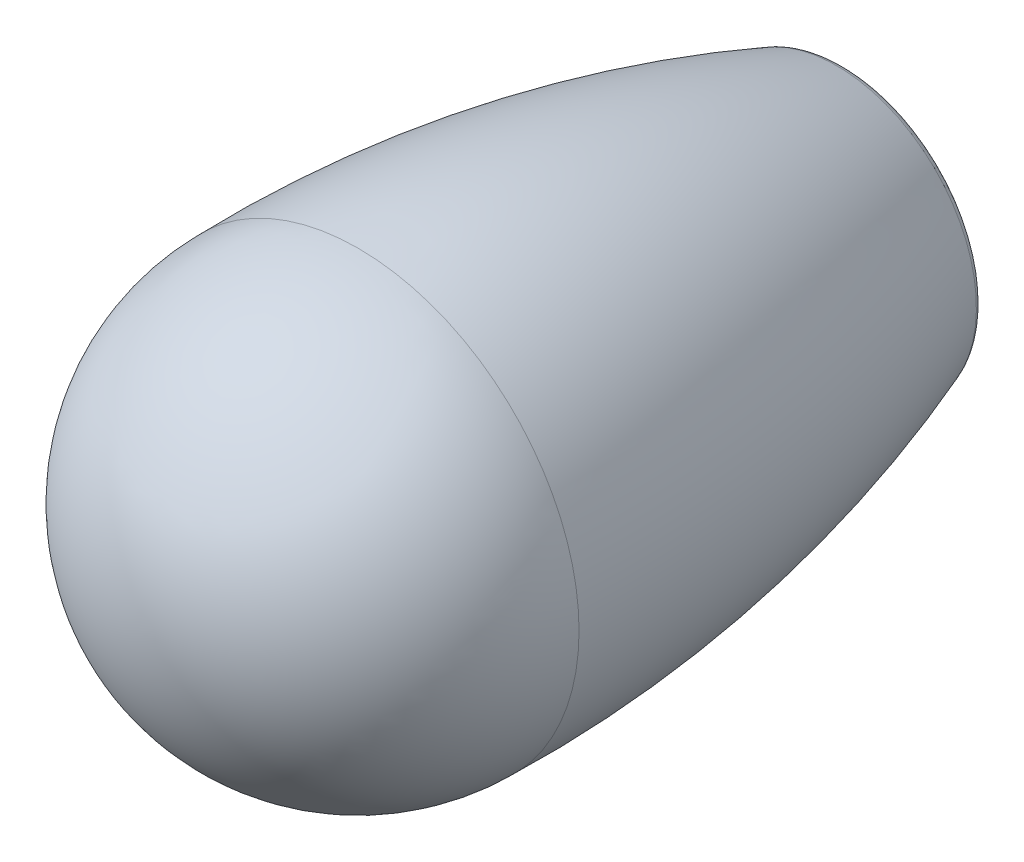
ISO-10303-21;
HEADER;
FILE_DESCRIPTION(('STEP AP214'),'2;1');
FILE_NAME('part.step','',(''),(''),'','','');
FILE_SCHEMA(('AUTOMOTIVE_DESIGN { 1 0 10303 214 1 1 1 1 }'));
ENDSEC;
DATA;
#1=APPLICATION_CONTEXT('core data for automotive mechanical design processes');
#2=APPLICATION_PROTOCOL_DEFINITION('international standard','automotive_design',2000,#1);
#3=PRODUCT_CONTEXT('',#1,'mechanical');
#4=PRODUCT('Part','Part','',(#3));
#5=PRODUCT_RELATED_PRODUCT_CATEGORY('part','',(#4));
#6=PRODUCT_DEFINITION_FORMATION('','',#4);
#7=PRODUCT_DEFINITION_CONTEXT('part definition',#1,'design');
#8=PRODUCT_DEFINITION('design','',#6,#7);
#9=PRODUCT_DEFINITION_SHAPE('','',#8);
#10=(LENGTH_UNIT() NAMED_UNIT(*) SI_UNIT(.MILLI.,.METRE.));
#11=(NAMED_UNIT(*) PLANE_ANGLE_UNIT() SI_UNIT($,.RADIAN.));
#12=(NAMED_UNIT(*) SI_UNIT($,.STERADIAN.) SOLID_ANGLE_UNIT());
#13=UNCERTAINTY_MEASURE_WITH_UNIT(LENGTH_MEASURE(1.E-05),#10,'distance_accuracy_value','');
#14=(GEOMETRIC_REPRESENTATION_CONTEXT(3) GLOBAL_UNCERTAINTY_ASSIGNED_CONTEXT((#13)) GLOBAL_UNIT_ASSIGNED_CONTEXT((#10,
#11,#12)) REPRESENTATION_CONTEXT('',''));
#15=CARTESIAN_POINT('',(0.,0.,0.));
#16=DIRECTION('',(0.,0.,1.));
#17=DIRECTION('',(1.,0.,0.));
#18=AXIS2_PLACEMENT_3D('',#15,#16,#17);
#19=CARTESIAN_POINT('',(0.,-1.38777878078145E-13,37.5));
#20=DIRECTION('',(0.,0.,-1.));
#21=DIRECTION('',(0.,1.,0.));
#22=AXIS2_PLACEMENT_3D('',#19,#20,#21);
#23=SPHERICAL_SURFACE('',#22,17.);
#24=CARTESIAN_POINT('',(0.,0.,37.500000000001));
#25=DIRECTION('',(0.,0.,-1.));
#26=DIRECTION('',(0.,-1.,0.));
#27=AXIS2_PLACEMENT_3D('',#24,#25,#26);
#28=CIRCLE('',#27,17.);
#29=CARTESIAN_POINT('',(0.,-17.,37.500000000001));
#30=VERTEX_POINT('',#29);
#31=EDGE_CURVE('E18',#30,#30,#28,.T.);
#32=ORIENTED_EDGE('',*,*,#31,.F.);
#33=EDGE_LOOP('',(#32));
#34=FACE_BOUND('',#33,.T.);
#35=ADVANCED_FACE('F12',(#34),#23,.T.);
#36=CARTESIAN_POINT('',(0.,0.,35.6035649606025));
#37=DIRECTION('',(0.,0.,-1.));
#38=DIRECTION('',(0.,-1.,0.));
#39=AXIS2_PLACEMENT_3D('',#36,#37,#38);
#40=DEGENERATE_TOROIDAL_SURFACE('',#39,83.482105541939,100.5,.F.);
#41=CARTESIAN_POINT('',(0.,0.,0.652225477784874));
#42=DIRECTION('',(0.,0.,-1.));
#43=DIRECTION('',(0.,-1.,0.));
#44=AXIS2_PLACEMENT_3D('',#41,#42,#43);
#45=CIRCLE('',#44,10.7445035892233);
#46=CARTESIAN_POINT('',(0.,-10.7445035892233,0.652225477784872));
#47=VERTEX_POINT('',#46);
#48=EDGE_CURVE('E22',#47,#47,#45,.T.);
#49=ORIENTED_EDGE('',*,*,#48,.F.);
#50=EDGE_LOOP('',(#49));
#51=FACE_BOUND('',#50,.T.);
#52=ORIENTED_EDGE('',*,*,#31,.T.);
#53=EDGE_LOOP('',(#52));
#54=FACE_BOUND('',#53,.T.);
#55=ADVANCED_FACE('F59',(#51,#54),#40,.F.);
#56=CARTESIAN_POINT('',(0.,0.,1.00000000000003));
#57=DIRECTION('',(0.,0.,-1.));
#58=DIRECTION('',(0.,-1.,0.));
#59=AXIS2_PLACEMENT_3D('',#56,#57,#58);
#60=TOROIDAL_SURFACE('',#59,9.80692538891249,1.);
#61=CARTESIAN_POINT('',(0.,0.,0.));
#62=DIRECTION('',(0.,0.,-1.));
#63=DIRECTION('',(0.,-1.,0.));
#64=AXIS2_PLACEMENT_3D('',#61,#62,#63);
#65=CIRCLE('',#64,9.8069253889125);
#66=CARTESIAN_POINT('',(0.,-9.8069253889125,0.));
#67=VERTEX_POINT('',#66);
#68=EDGE_CURVE('E26',#67,#67,#65,.T.);
#69=ORIENTED_EDGE('',*,*,#68,.F.);
#70=EDGE_LOOP('',(#69));
#71=FACE_BOUND('',#70,.T.);
#72=ORIENTED_EDGE('',*,*,#48,.T.);
#73=EDGE_LOOP('',(#72));
#74=FACE_BOUND('',#73,.T.);
#75=ADVANCED_FACE('F55',(#71,#74),#60,.T.);
#76=CARTESIAN_POINT('',(0.,6.,0.));
#77=DIRECTION('',(0.,0.,1.));
#78=DIRECTION('',(0.,1.,0.));
#79=AXIS2_PLACEMENT_3D('',#76,#77,#78);
#80=PLANE('',#79);
#81=ORIENTED_EDGE('',*,*,#68,.T.);
#82=EDGE_LOOP('',(#81));
#83=FACE_BOUND('',#82,.T.);
#84=CARTESIAN_POINT('',(0.,0.,0.));
#85=DIRECTION('',(0.,0.,1.));
#86=DIRECTION('',(1.,0.,0.));
#87=AXIS2_PLACEMENT_3D('',#84,#85,#86);
#88=CIRCLE('',#87,5.25);
#89=CARTESIAN_POINT('',(5.25,0.,0.));
#90=VERTEX_POINT('',#89);
#91=EDGE_CURVE('E37',#90,#90,#88,.T.);
#92=ORIENTED_EDGE('',*,*,#91,.T.);
#93=EDGE_LOOP('',(#92));
#94=FACE_BOUND('',#93,.T.);
#95=ADVANCED_FACE('F41',(#83,#94),#80,.F.);
#96=CARTESIAN_POINT('',(0.,0.,60.858882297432));
#97=DIRECTION('',(0.,0.,1.));
#98=DIRECTION('',(1.,0.,0.));
#99=AXIS2_PLACEMENT_3D('',#96,#97,#98);
#100=CYLINDRICAL_SURFACE('',#99,5.25);
#101=ORIENTED_EDGE('',*,*,#91,.F.);
#102=EDGE_LOOP('',(#101));
#103=FACE_BOUND('',#102,.T.);
#104=CARTESIAN_POINT('',(0.,0.,8.));
#105=DIRECTION('',(0.,0.,1.));
#106=DIRECTION('',(0.,-1.,0.));
#107=AXIS2_PLACEMENT_3D('',#104,#105,#106);
#108=CIRCLE('',#107,5.25);
#109=CARTESIAN_POINT('',(0.,-5.25,8.));
#110=VERTEX_POINT('',#109);
#111=EDGE_CURVE('E8',#110,#110,#108,.T.);
#112=ORIENTED_EDGE('',*,*,#111,.T.);
#113=EDGE_LOOP('',(#112));
#114=FACE_BOUND('',#113,.T.);
#115=ADVANCED_FACE('F43',(#103,#114),#100,.F.);
#116=CARTESIAN_POINT('',(0.,0.,35.));
#117=DIRECTION('',(0.,0.,1.));
#118=DIRECTION('',(0.,1.,0.));
#119=AXIS2_PLACEMENT_3D('',#116,#117,#118);
#120=PLANE('',#119);
#121=CARTESIAN_POINT('',(0.,0.,35.));
#122=DIRECTION('',(0.,0.,-1.));
#123=DIRECTION('',(0.,-1.,0.));
#124=AXIS2_PLACEMENT_3D('',#121,#122,#123);
#125=CIRCLE('',#124,4.99999999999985);
#126=CARTESIAN_POINT('',(0.,-4.99999999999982,35.));
#127=VERTEX_POINT('',#126);
#128=EDGE_CURVE('E34',#127,#127,#125,.T.);
#129=ORIENTED_EDGE('',*,*,#128,.T.);
#130=EDGE_LOOP('',(#129));
#131=FACE_BOUND('',#130,.T.);
#132=ADVANCED_FACE('F45',(#131),#120,.F.);
#133=CARTESIAN_POINT('',(0.,0.,-5.));
#134=DIRECTION('',(0.,0.,-1.));
#135=DIRECTION('',(0.,-1.,0.));
#136=AXIS2_PLACEMENT_3D('',#133,#134,#135);
#137=CYLINDRICAL_SURFACE('',#136,4.99999999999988);
#138=ORIENTED_EDGE('',*,*,#128,.F.);
#139=EDGE_LOOP('',(#138));
#140=FACE_BOUND('',#139,.T.);
#141=CARTESIAN_POINT('',(0.,0.,8.));
#142=DIRECTION('',(0.,0.,-1.));
#143=DIRECTION('',(0.,-1.,0.));
#144=AXIS2_PLACEMENT_3D('',#141,#142,#143);
#145=CIRCLE('',#144,4.99999999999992);
#146=CARTESIAN_POINT('',(0.,-4.99999999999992,8.));
#147=VERTEX_POINT('',#146);
#148=EDGE_CURVE('E31',#147,#147,#145,.T.);
#149=ORIENTED_EDGE('',*,*,#148,.T.);
#150=EDGE_LOOP('',(#149));
#151=FACE_BOUND('',#150,.T.);
#152=ADVANCED_FACE('F52',(#140,#151),#137,.F.);
#153=CARTESIAN_POINT('',(0.,4.99999999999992,8.));
#154=DIRECTION('',(0.,0.,1.));
#155=DIRECTION('',(0.,1.,0.));
#156=AXIS2_PLACEMENT_3D('',#153,#154,#155);
#157=PLANE('',#156);
#158=ORIENTED_EDGE('',*,*,#148,.F.);
#159=EDGE_LOOP('',(#158));
#160=FACE_BOUND('',#159,.T.);
#161=ORIENTED_EDGE('',*,*,#111,.F.);
#162=EDGE_LOOP('',(#161));
#163=FACE_BOUND('',#162,.T.);
#164=ADVANCED_FACE('F72',(#160,#163),#157,.F.);
#165=CLOSED_SHELL('',(#35,#55,#75,#95,#115,#132,#152,#164));
#166=MANIFOLD_SOLID_BREP('B1',#165);
#167=ADVANCED_BREP_SHAPE_REPRESENTATION('',(#18,#166),#14);
#168=SHAPE_DEFINITION_REPRESENTATION(#9,#167);
ENDSEC;
END-ISO-10303-21;
